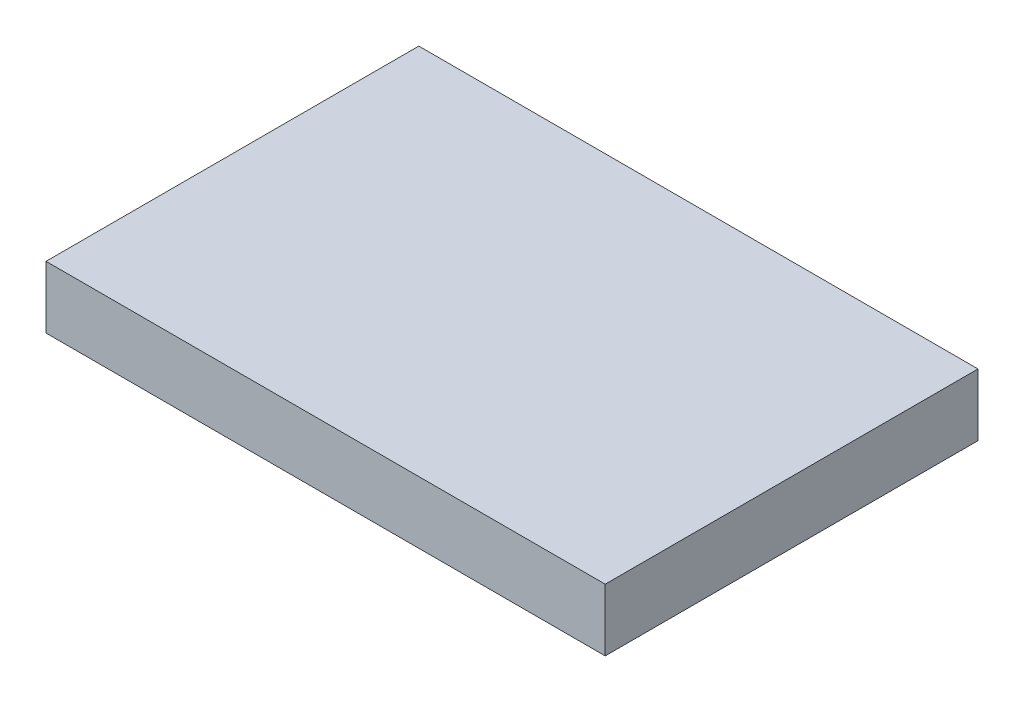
from build123d import *

# Parameters (mm, degrees)
SKETCH1_W      = 180
SKETCH1_H      = 120
EXTRUDE1_DEPTH = 20


with BuildPart() as part:
    # Sketch1 → Extrude1 (new body)
    with BuildSketch(Plane(origin=(0, 0, 0), x_dir=(1, 0, 0), z_dir=(0, 1, 0))):
        with Locations((90, 60)):
            Rectangle(SKETCH1_W, SKETCH1_H)
    extrude(amount=EXTRUDE1_DEPTH)


solid = part.part
